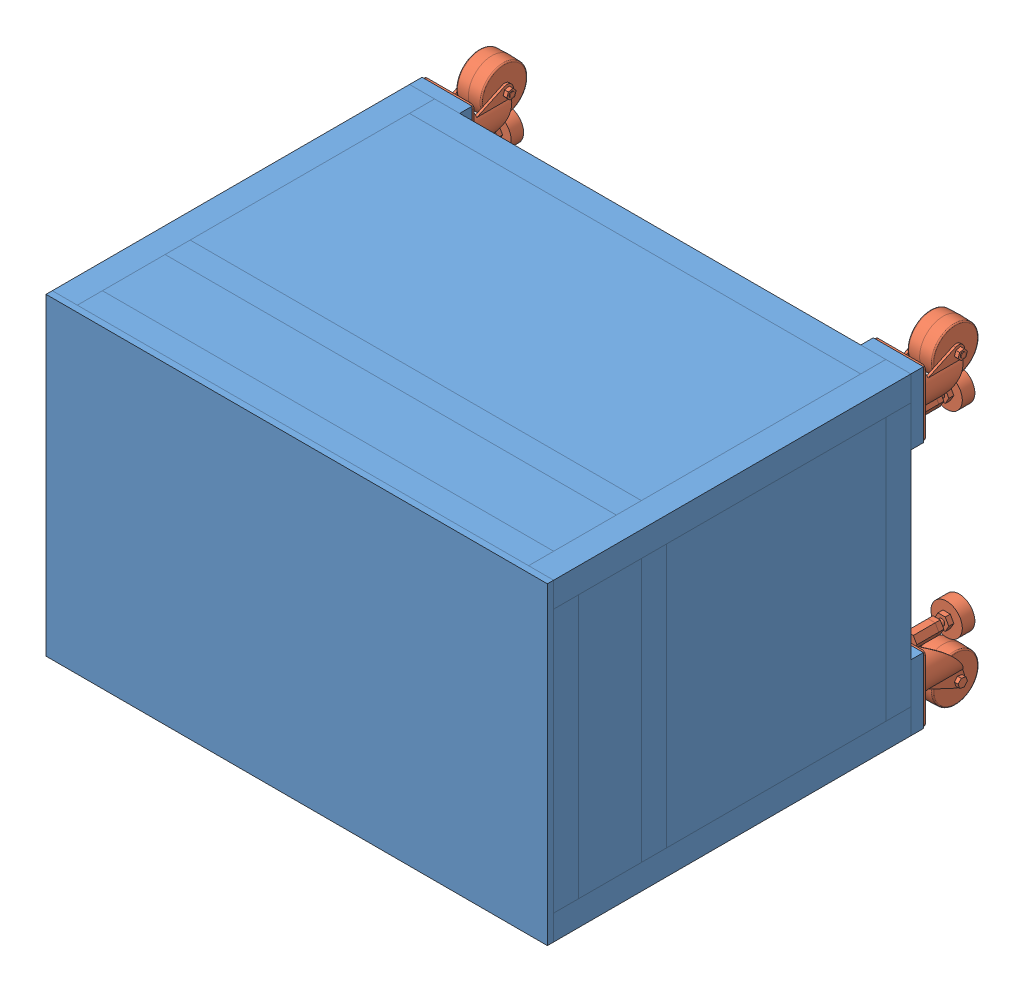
SolidWorks assembly HTA型工作台（含脚轮）.SLDASM, configuration 默认 (file format 9000). Lengths in mm.
Overall size (800 529.03 708.89).
5 component instances, 2 part files, 12 mates.
Components (placement in the parent):
- HTA豪华型工作台-1: HTA豪华型工作台.SLDPRT [默认] at (36.2621 21.9224 1090) size (800 515 600)
- 脚轮-3寸-1: 脚轮-3寸.sldprt [默认] at (-323.7379 -175.5776 497) x (1 0 0) z (0 -1 0) size (80 108.89 131.53)
- 脚轮-3寸-2: 脚轮-3寸.sldprt [默认] at (396.2621 -175.5776 497) x (1 0 0) z (0 -1 0) size (80 108.89 131.53)
- 脚轮-3寸-3: 脚轮-3寸.sldprt [默认] at (396.2621 219.4224 497) x (-1 0 0) z (0 1 0) size (80 108.89 131.53)
- 脚轮-3寸-4: 脚轮-3寸.sldprt [默认] at (-323.7379 219.4224 497) x (-1 0 0) z (0 1 0) size (80 108.89 131.53)
Mates (geometry in assembly coordinates):
- 重合1: coincident anti-aligned: plane of HTA豪华型工作台-1 through (36.2621 21.9224 500) normal (0 0 -1); plane of 脚轮-3寸-1 through (-288.7379 -223.0776 500) normal (0 0 1)
- 重合2: coincident aligned: plane of HTA豪华型工作台-1 through (-363.7379 -228.0776 500) normal (0 -1 0); plane of 脚轮-3寸-1 through (-358.7379 -228.0776 500) normal (0 -1 0)
- 重合3: coincident aligned: plane of HTA豪华型工作台-1 through (-363.7379 -228.0776 500) normal (-1 0 0); plane of 脚轮-3寸-1 through (-363.7379 -128.0776 500) normal (-1 0 0)
- 重合4: coincident anti-aligned: plane of HTA豪华型工作台-1 through (36.2621 21.9224 500) normal (0 0 -1); plane of 脚轮-3寸-2 through (431.2621 -223.0776 500) normal (0 0 1)
- 重合5: coincident aligned: plane of HTA豪华型工作台-1 through (436.2621 -228.0776 500) normal (0 -1 0); plane of 脚轮-3寸-2 through (361.2621 -228.0776 500) normal (0 -1 0)
- 重合6: coincident aligned: plane of HTA豪华型工作台-1 through (436.2621 -228.0776 500) normal (1 0 0); plane of 脚轮-3寸-2 through (436.2621 -223.0776 500) normal (1 0 0)
- 重合7: coincident anti-aligned: plane of HTA豪华型工作台-1 through (36.2621 21.9224 500) normal (0 0 -1); plane of 脚轮-3寸-3 through (361.2621 266.9224 500) normal (0 0 1)
- 重合8: coincident aligned: plane of HTA豪华型工作台-1 through (436.2621 271.9224 500) normal (1 0 0); plane of 脚轮-3寸-3 through (436.2621 171.9224 500) normal (1 0 0)
- 重合9: coincident aligned: plane of HTA豪华型工作台-1 through (436.2621 271.9224 500) normal (0 1 0); plane of 脚轮-3寸-3 through (431.2621 271.9224 500) normal (0 1 0)
- 重合10: coincident anti-aligned: plane of HTA豪华型工作台-1 through (36.2621 21.9224 500) normal (0 0 -1); plane of 脚轮-3寸-4 through (-358.7379 266.9224 500) normal (0 0 1)
- 重合11: coincident aligned: plane of HTA豪华型工作台-1 through (-363.7379 271.9224 500) normal (0 1 0); plane of 脚轮-3寸-4 through (-288.7379 271.9224 500) normal (0 1 0)
- 重合12: coincident aligned: plane of HTA豪华型工作台-1 through (-363.7379 271.9224 500) normal (-1 0 0); plane of 脚轮-3寸-4 through (-363.7379 266.9224 500) normal (-1 0 0)
